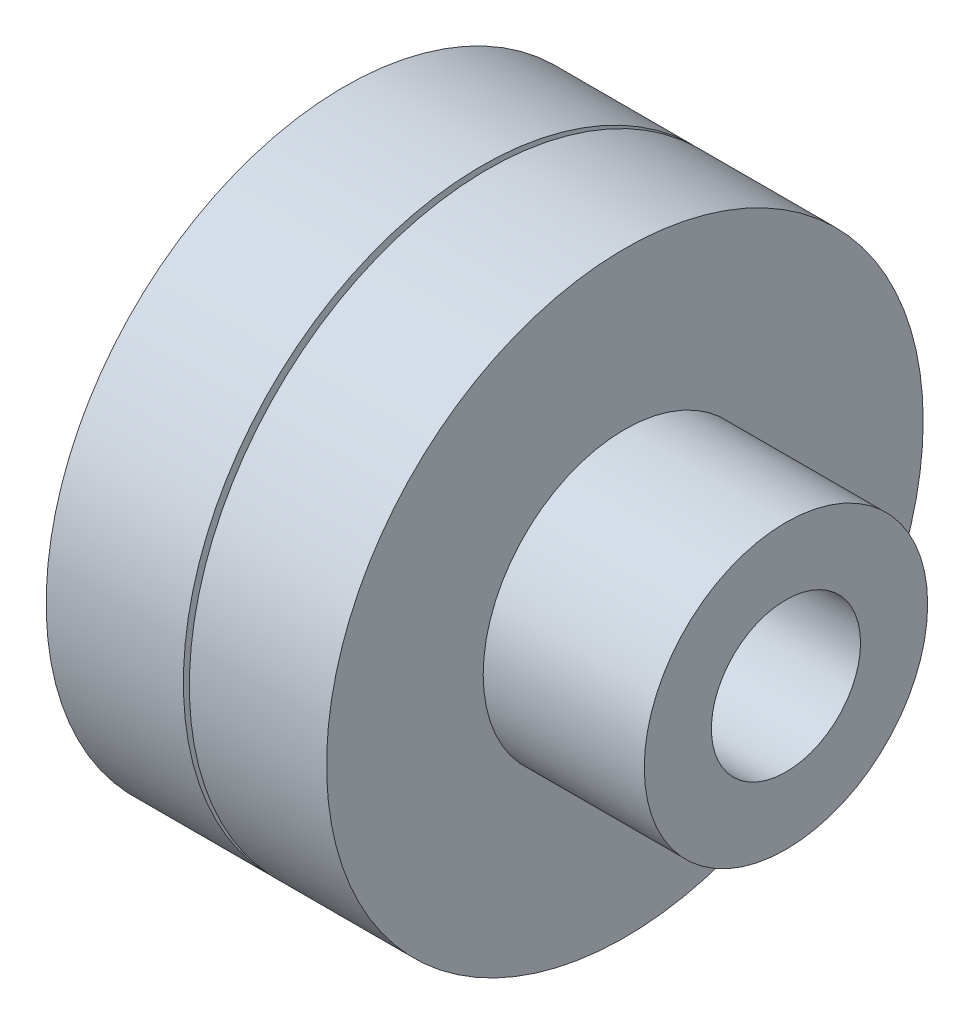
ISO-10303-21;
HEADER;
FILE_DESCRIPTION(('STEP AP214'),'2;1');
FILE_NAME('part.step','',(''),(''),'','','');
FILE_SCHEMA(('AUTOMOTIVE_DESIGN { 1 0 10303 214 1 1 1 1 }'));
ENDSEC;
DATA;
#1=APPLICATION_CONTEXT('core data for automotive mechanical design processes');
#2=APPLICATION_PROTOCOL_DEFINITION('international standard','automotive_design',2000,#1);
#3=PRODUCT_CONTEXT('',#1,'mechanical');
#4=PRODUCT('Part','Part','',(#3));
#5=PRODUCT_RELATED_PRODUCT_CATEGORY('part','',(#4));
#6=PRODUCT_DEFINITION_FORMATION('','',#4);
#7=PRODUCT_DEFINITION_CONTEXT('part definition',#1,'design');
#8=PRODUCT_DEFINITION('design','',#6,#7);
#9=PRODUCT_DEFINITION_SHAPE('','',#8);
#10=(LENGTH_UNIT() NAMED_UNIT(*) SI_UNIT(.MILLI.,.METRE.));
#11=(NAMED_UNIT(*) PLANE_ANGLE_UNIT() SI_UNIT($,.RADIAN.));
#12=(NAMED_UNIT(*) SI_UNIT($,.STERADIAN.) SOLID_ANGLE_UNIT());
#13=UNCERTAINTY_MEASURE_WITH_UNIT(LENGTH_MEASURE(1.E-05),#10,'distance_accuracy_value','');
#14=(GEOMETRIC_REPRESENTATION_CONTEXT(3) GLOBAL_UNCERTAINTY_ASSIGNED_CONTEXT((#13)) GLOBAL_UNIT_ASSIGNED_CONTEXT((#10,
#11,#12)) REPRESENTATION_CONTEXT('',''));
#15=CARTESIAN_POINT('',(0.,0.,0.));
#16=DIRECTION('',(0.,0.,1.));
#17=DIRECTION('',(1.,0.,0.));
#18=AXIS2_PLACEMENT_3D('',#15,#16,#17);
#19=CARTESIAN_POINT('',(0.,0.,0.));
#20=DIRECTION('',(1.,0.,0.));
#21=DIRECTION('',(0.,0.,-1.));
#22=AXIS2_PLACEMENT_3D('',#19,#20,#21);
#23=CYLINDRICAL_SURFACE('',#22,47.5);
#24=CARTESIAN_POINT('',(0.,0.,0.));
#25=DIRECTION('',(1.,0.,0.));
#26=DIRECTION('',(0.,0.,-1.));
#27=AXIS2_PLACEMENT_3D('',#24,#25,#26);
#28=CIRCLE('',#27,47.5);
#29=CARTESIAN_POINT('',(0.,0.,-47.5));
#30=VERTEX_POINT('',#29);
#31=EDGE_CURVE('E11',#30,#30,#28,.T.);
#32=ORIENTED_EDGE('',*,*,#31,.F.);
#33=EDGE_LOOP('',(#32));
#34=FACE_BOUND('',#33,.T.);
#35=CARTESIAN_POINT('',(-54.,0.,0.));
#36=DIRECTION('',(1.,0.,0.));
#37=DIRECTION('',(0.,0.,-1.));
#38=AXIS2_PLACEMENT_3D('',#35,#36,#37);
#39=CIRCLE('',#38,47.5);
#40=CARTESIAN_POINT('',(-54.,0.,-47.5));
#41=VERTEX_POINT('',#40);
#42=EDGE_CURVE('E60',#41,#41,#39,.T.);
#43=ORIENTED_EDGE('',*,*,#42,.T.);
#44=EDGE_LOOP('',(#43));
#45=FACE_BOUND('',#44,.T.);
#46=ADVANCED_FACE('F38',(#34,#45),#23,.T.);
#47=CARTESIAN_POINT('',(0.,-47.5,0.));
#48=DIRECTION('',(-1.,0.,0.));
#49=DIRECTION('',(0.,0.,1.));
#50=AXIS2_PLACEMENT_3D('',#47,#48,#49);
#51=PLANE('',#50);
#52=CARTESIAN_POINT('',(0.,0.,0.));
#53=DIRECTION('',(1.,0.,0.));
#54=DIRECTION('',(0.,0.,-1.));
#55=AXIS2_PLACEMENT_3D('',#52,#53,#54);
#56=CIRCLE('',#55,25.);
#57=CARTESIAN_POINT('',(0.,0.,-25.));
#58=VERTEX_POINT('',#57);
#59=EDGE_CURVE('E44',#58,#58,#56,.T.);
#60=ORIENTED_EDGE('',*,*,#59,.F.);
#61=EDGE_LOOP('',(#60));
#62=FACE_BOUND('',#61,.T.);
#63=ORIENTED_EDGE('',*,*,#31,.T.);
#64=EDGE_LOOP('',(#63));
#65=FACE_BOUND('',#64,.T.);
#66=ADVANCED_FACE('F85',(#62,#65),#51,.F.);
#67=CARTESIAN_POINT('',(0.,0.,0.));
#68=DIRECTION('',(1.,0.,0.));
#69=DIRECTION('',(0.,0.,-1.));
#70=AXIS2_PLACEMENT_3D('',#67,#68,#69);
#71=CYLINDRICAL_SURFACE('',#70,25.);
#72=CARTESIAN_POINT('',(-100.,0.,0.));
#73=DIRECTION('',(1.,0.,0.));
#74=DIRECTION('',(0.,0.,-1.));
#75=AXIS2_PLACEMENT_3D('',#72,#73,#74);
#76=CIRCLE('',#75,25.);
#77=CARTESIAN_POINT('',(-100.,0.,-25.));
#78=VERTEX_POINT('',#77);
#79=EDGE_CURVE('E48',#78,#78,#76,.T.);
#80=ORIENTED_EDGE('',*,*,#79,.F.);
#81=EDGE_LOOP('',(#80));
#82=FACE_BOUND('',#81,.T.);
#83=ORIENTED_EDGE('',*,*,#59,.T.);
#84=EDGE_LOOP('',(#83));
#85=FACE_BOUND('',#84,.T.);
#86=ADVANCED_FACE('F80',(#82,#85),#71,.F.);
#87=CARTESIAN_POINT('',(-100.,-100.,0.));
#88=DIRECTION('',(1.,0.,0.));
#89=DIRECTION('',(0.,0.,-1.));
#90=AXIS2_PLACEMENT_3D('',#87,#88,#89);
#91=PLANE('',#90);
#92=CARTESIAN_POINT('',(-100.,0.,0.));
#93=DIRECTION('',(1.,0.,0.));
#94=DIRECTION('',(0.,0.,-1.));
#95=AXIS2_PLACEMENT_3D('',#92,#93,#94);
#96=CIRCLE('',#95,100.);
#97=CARTESIAN_POINT('',(-100.,0.,-100.));
#98=VERTEX_POINT('',#97);
#99=EDGE_CURVE('E52',#98,#98,#96,.T.);
#100=ORIENTED_EDGE('',*,*,#99,.F.);
#101=EDGE_LOOP('',(#100));
#102=FACE_BOUND('',#101,.T.);
#103=ORIENTED_EDGE('',*,*,#79,.T.);
#104=EDGE_LOOP('',(#103));
#105=FACE_BOUND('',#104,.T.);
#106=ADVANCED_FACE('F74',(#102,#105),#91,.F.);
#107=CARTESIAN_POINT('',(0.,0.,0.));
#108=DIRECTION('',(1.,0.,0.));
#109=DIRECTION('',(0.,0.,-1.));
#110=AXIS2_PLACEMENT_3D('',#107,#108,#109);
#111=CYLINDRICAL_SURFACE('',#110,100.);
#112=CARTESIAN_POINT('',(-54.,0.,0.));
#113=DIRECTION('',(1.,0.,0.));
#114=DIRECTION('',(0.,0.,-1.));
#115=AXIS2_PLACEMENT_3D('',#112,#113,#114);
#116=CIRCLE('',#115,100.);
#117=CARTESIAN_POINT('',(-54.,0.,-100.));
#118=VERTEX_POINT('',#117);
#119=EDGE_CURVE('E57',#118,#118,#116,.T.);
#120=ORIENTED_EDGE('',*,*,#119,.F.);
#121=EDGE_LOOP('',(#120));
#122=FACE_BOUND('',#121,.T.);
#123=ORIENTED_EDGE('',*,*,#99,.T.);
#124=EDGE_LOOP('',(#123));
#125=FACE_BOUND('',#124,.T.);
#126=ADVANCED_FACE('F68',(#122,#125),#111,.T.);
#127=CARTESIAN_POINT('',(-54.,-100.,0.));
#128=DIRECTION('',(-1.,0.,0.));
#129=DIRECTION('',(0.,0.,1.));
#130=AXIS2_PLACEMENT_3D('',#127,#128,#129);
#131=PLANE('',#130);
#132=ORIENTED_EDGE('',*,*,#42,.F.);
#133=EDGE_LOOP('',(#132));
#134=FACE_BOUND('',#133,.T.);
#135=ORIENTED_EDGE('',*,*,#119,.T.);
#136=EDGE_LOOP('',(#135));
#137=FACE_BOUND('',#136,.T.);
#138=ADVANCED_FACE('F65',(#134,#137),#131,.F.);
#139=CLOSED_SHELL('',(#46,#66,#86,#106,#126,#138));
#140=MANIFOLD_SOLID_BREP('B2',#139);
#141=CARTESIAN_POINT('',(-167.,-47.5,0.));
#142=DIRECTION('',(1.,0.,0.));
#143=DIRECTION('',(0.,0.,-1.));
#144=AXIS2_PLACEMENT_3D('',#141,#142,#143);
#145=PLANE('',#144);
#146=CARTESIAN_POINT('',(-167.,0.,0.));
#147=DIRECTION('',(1.,0.,0.));
#148=DIRECTION('',(0.,0.,-1.));
#149=AXIS2_PLACEMENT_3D('',#146,#147,#148);
#150=CIRCLE('',#149,47.5);
#151=CARTESIAN_POINT('',(-167.,0.,-47.5));
#152=VERTEX_POINT('',#151);
#153=EDGE_CURVE('E151',#152,#152,#150,.T.);
#154=ORIENTED_EDGE('',*,*,#153,.F.);
#155=EDGE_LOOP('',(#154));
#156=FACE_BOUND('',#155,.T.);
#157=CARTESIAN_POINT('',(-167.,0.,0.));
#158=DIRECTION('',(1.,0.,0.));
#159=DIRECTION('',(0.,0.,-1.));
#160=AXIS2_PLACEMENT_3D('',#157,#158,#159);
#161=CIRCLE('',#160,30.);
#162=CARTESIAN_POINT('',(-167.,0.,-30.));
#163=VERTEX_POINT('',#162);
#164=EDGE_CURVE('E37',#163,#163,#161,.T.);
#165=ORIENTED_EDGE('',*,*,#164,.T.);
#166=EDGE_LOOP('',(#165));
#167=FACE_BOUND('',#166,.T.);
#168=ADVANCED_FACE('F129',(#156,#167),#145,.F.);
#169=CARTESIAN_POINT('',(0.,0.,0.));
#170=DIRECTION('',(1.,0.,0.));
#171=DIRECTION('',(0.,0.,-1.));
#172=AXIS2_PLACEMENT_3D('',#169,#170,#171);
#173=CYLINDRICAL_SURFACE('',#172,30.);
#174=ORIENTED_EDGE('',*,*,#164,.F.);
#175=EDGE_LOOP('',(#174));
#176=FACE_BOUND('',#175,.T.);
#177=CARTESIAN_POINT('',(-102.,0.,0.));
#178=DIRECTION('',(1.,0.,0.));
#179=DIRECTION('',(0.,0.,-1.));
#180=AXIS2_PLACEMENT_3D('',#177,#178,#179);
#181=CIRCLE('',#180,30.);
#182=CARTESIAN_POINT('',(-102.,0.,-30.));
#183=VERTEX_POINT('',#182);
#184=EDGE_CURVE('E135',#183,#183,#181,.T.);
#185=ORIENTED_EDGE('',*,*,#184,.T.);
#186=EDGE_LOOP('',(#185));
#187=FACE_BOUND('',#186,.T.);
#188=ADVANCED_FACE('F158',(#176,#187),#173,.F.);
#189=CARTESIAN_POINT('',(-102.,-100.,0.));
#190=DIRECTION('',(-1.,0.,0.));
#191=DIRECTION('',(0.,0.,1.));
#192=AXIS2_PLACEMENT_3D('',#189,#190,#191);
#193=PLANE('',#192);
#194=ORIENTED_EDGE('',*,*,#184,.F.);
#195=EDGE_LOOP('',(#194));
#196=FACE_BOUND('',#195,.T.);
#197=CARTESIAN_POINT('',(-102.,0.,0.));
#198=DIRECTION('',(1.,0.,0.));
#199=DIRECTION('',(0.,0.,-1.));
#200=AXIS2_PLACEMENT_3D('',#197,#198,#199);
#201=CIRCLE('',#200,100.);
#202=CARTESIAN_POINT('',(-102.,0.,-100.));
#203=VERTEX_POINT('',#202);
#204=EDGE_CURVE('E139',#203,#203,#201,.T.);
#205=ORIENTED_EDGE('',*,*,#204,.T.);
#206=EDGE_LOOP('',(#205));
#207=FACE_BOUND('',#206,.T.);
#208=ADVANCED_FACE('F162',(#196,#207),#193,.F.);
#209=CARTESIAN_POINT('',(0.,0.,0.));
#210=DIRECTION('',(1.,0.,0.));
#211=DIRECTION('',(0.,0.,-1.));
#212=AXIS2_PLACEMENT_3D('',#209,#210,#211);
#213=CYLINDRICAL_SURFACE('',#212,100.);
#214=ORIENTED_EDGE('',*,*,#204,.F.);
#215=EDGE_LOOP('',(#214));
#216=FACE_BOUND('',#215,.T.);
#217=CARTESIAN_POINT('',(-148.,0.,0.));
#218=DIRECTION('',(1.,0.,0.));
#219=DIRECTION('',(0.,0.,-1.));
#220=AXIS2_PLACEMENT_3D('',#217,#218,#219);
#221=CIRCLE('',#220,100.);
#222=CARTESIAN_POINT('',(-148.,0.,-100.));
#223=VERTEX_POINT('',#222);
#224=EDGE_CURVE('E143',#223,#223,#221,.T.);
#225=ORIENTED_EDGE('',*,*,#224,.T.);
#226=EDGE_LOOP('',(#225));
#227=FACE_BOUND('',#226,.T.);
#228=ADVANCED_FACE('F167',(#216,#227),#213,.T.);
#229=CARTESIAN_POINT('',(-148.,-47.5,0.));
#230=DIRECTION('',(1.,0.,0.));
#231=DIRECTION('',(0.,0.,-1.));
#232=AXIS2_PLACEMENT_3D('',#229,#230,#231);
#233=PLANE('',#232);
#234=ORIENTED_EDGE('',*,*,#224,.F.);
#235=EDGE_LOOP('',(#234));
#236=FACE_BOUND('',#235,.T.);
#237=CARTESIAN_POINT('',(-148.,0.,0.));
#238=DIRECTION('',(1.,0.,0.));
#239=DIRECTION('',(0.,0.,-1.));
#240=AXIS2_PLACEMENT_3D('',#237,#238,#239);
#241=CIRCLE('',#240,47.5);
#242=CARTESIAN_POINT('',(-148.,0.,-47.5));
#243=VERTEX_POINT('',#242);
#244=EDGE_CURVE('E148',#243,#243,#241,.T.);
#245=ORIENTED_EDGE('',*,*,#244,.T.);
#246=EDGE_LOOP('',(#245));
#247=FACE_BOUND('',#246,.T.);
#248=ADVANCED_FACE('F173',(#236,#247),#233,.F.);
#249=CARTESIAN_POINT('',(0.,0.,0.));
#250=DIRECTION('',(1.,0.,0.));
#251=DIRECTION('',(0.,0.,-1.));
#252=AXIS2_PLACEMENT_3D('',#249,#250,#251);
#253=CYLINDRICAL_SURFACE('',#252,47.5);
#254=ORIENTED_EDGE('',*,*,#244,.F.);
#255=EDGE_LOOP('',(#254));
#256=FACE_BOUND('',#255,.T.);
#257=ORIENTED_EDGE('',*,*,#153,.T.);
#258=EDGE_LOOP('',(#257));
#259=FACE_BOUND('',#258,.T.);
#260=ADVANCED_FACE('F155',(#256,#259),#253,.T.);
#261=CLOSED_SHELL('',(#168,#188,#208,#228,#248,#260));
#262=MANIFOLD_SOLID_BREP('B6',#261);
#263=ADVANCED_BREP_SHAPE_REPRESENTATION('',(#18,#140,#262),#14);
#264=SHAPE_DEFINITION_REPRESENTATION(#9,#263);
ENDSEC;
END-ISO-10303-21;
